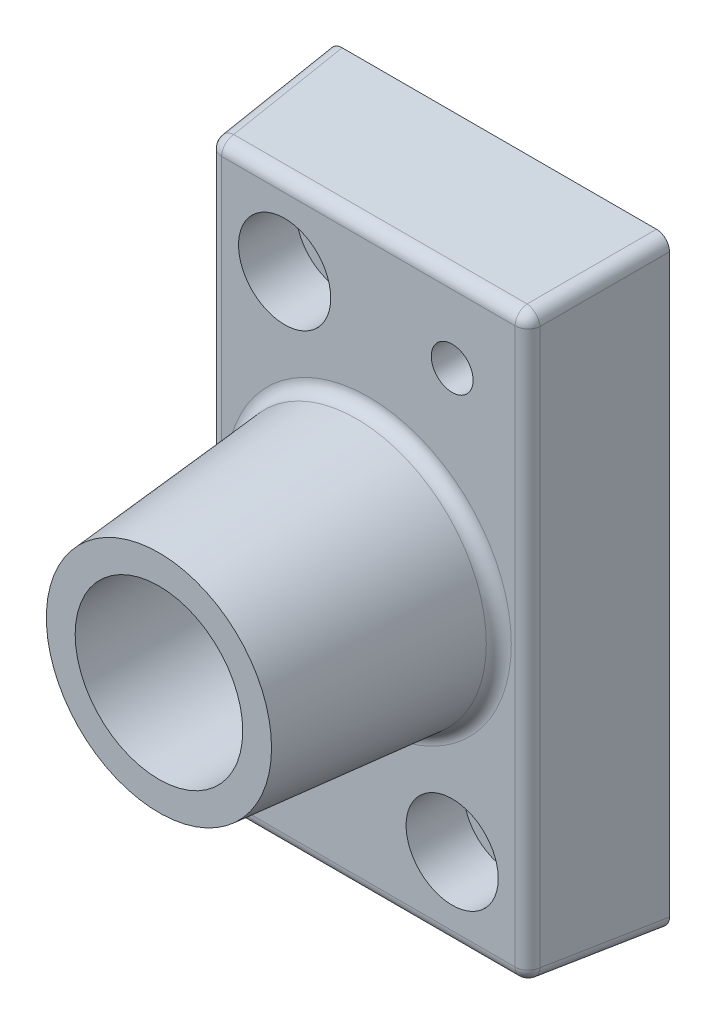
ISO-10303-21;
HEADER;
FILE_DESCRIPTION(('STEP AP214'),'2;1');
FILE_NAME('part.step','',(''),(''),'','','');
FILE_SCHEMA(('AUTOMOTIVE_DESIGN { 1 0 10303 214 1 1 1 1 }'));
ENDSEC;
DATA;
#1=APPLICATION_CONTEXT('core data for automotive mechanical design processes');
#2=APPLICATION_PROTOCOL_DEFINITION('international standard','automotive_design',2000,#1);
#3=PRODUCT_CONTEXT('',#1,'mechanical');
#4=PRODUCT('Part','Part','',(#3));
#5=PRODUCT_RELATED_PRODUCT_CATEGORY('part','',(#4));
#6=PRODUCT_DEFINITION_FORMATION('','',#4);
#7=PRODUCT_DEFINITION_CONTEXT('part definition',#1,'design');
#8=PRODUCT_DEFINITION('design','',#6,#7);
#9=PRODUCT_DEFINITION_SHAPE('','',#8);
#10=(LENGTH_UNIT() NAMED_UNIT(*) SI_UNIT(.MILLI.,.METRE.));
#11=(NAMED_UNIT(*) PLANE_ANGLE_UNIT() SI_UNIT($,.RADIAN.));
#12=(NAMED_UNIT(*) SI_UNIT($,.STERADIAN.) SOLID_ANGLE_UNIT());
#13=UNCERTAINTY_MEASURE_WITH_UNIT(LENGTH_MEASURE(1.E-05),#10,'distance_accuracy_value','');
#14=(GEOMETRIC_REPRESENTATION_CONTEXT(3) GLOBAL_UNCERTAINTY_ASSIGNED_CONTEXT((#13)) GLOBAL_UNIT_ASSIGNED_CONTEXT((#10,
#11,#12)) REPRESENTATION_CONTEXT('',''));
#15=CARTESIAN_POINT('',(0.,0.,0.));
#16=DIRECTION('',(0.,0.,1.));
#17=DIRECTION('',(1.,0.,0.));
#18=AXIS2_PLACEMENT_3D('',#15,#16,#17);
#19=CARTESIAN_POINT('',(-32.5,57.5000000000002,25.));
#20=DIRECTION('',(0.,0.,1.));
#21=DIRECTION('',(1.,0.,0.));
#22=AXIS2_PLACEMENT_3D('',#19,#20,#21);
#23=PLANE('',#22);
#24=CARTESIAN_POINT('',(-16.,-40.0000000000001,25.));
#25=DIRECTION('',(0.,0.,1.));
#26=DIRECTION('',(1.,0.,0.));
#27=AXIS2_PLACEMENT_3D('',#24,#25,#26);
#28=CIRCLE('',#27,4.);
#29=CARTESIAN_POINT('',(-12.,-40.0000000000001,25.));
#30=VERTEX_POINT('',#29);
#31=EDGE_CURVE('E529',#30,#30,#28,.T.);
#32=ORIENTED_EDGE('',*,*,#31,.F.);
#33=EDGE_LOOP('',(#32));
#34=FACE_BOUND('',#33,.T.);
#35=CARTESIAN_POINT('',(16.,40.,25.));
#36=DIRECTION('',(0.,0.,1.));
#37=DIRECTION('',(1.,0.,0.));
#38=AXIS2_PLACEMENT_3D('',#35,#36,#37);
#39=CIRCLE('',#38,4.);
#40=CARTESIAN_POINT('',(20.,40.,25.));
#41=VERTEX_POINT('',#40);
#42=EDGE_CURVE('E531',#41,#41,#39,.T.);
#43=ORIENTED_EDGE('',*,*,#42,.F.);
#44=EDGE_LOOP('',(#43));
#45=FACE_BOUND('',#44,.T.);
#46=CARTESIAN_POINT('',(16.0000000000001,-40.,25.));
#47=DIRECTION('',(0.,0.,1.));
#48=DIRECTION('',(1.,0.,0.));
#49=AXIS2_PLACEMENT_3D('',#46,#47,#48);
#50=CIRCLE('',#49,8.8);
#51=CARTESIAN_POINT('',(24.8000000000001,-40.,25.));
#52=VERTEX_POINT('',#51);
#53=EDGE_CURVE('E548',#52,#52,#50,.T.);
#54=ORIENTED_EDGE('',*,*,#53,.F.);
#55=EDGE_LOOP('',(#54));
#56=FACE_BOUND('',#55,.T.);
#57=CARTESIAN_POINT('',(-16.,40.,25.));
#58=DIRECTION('',(0.,0.,1.));
#59=DIRECTION('',(1.,0.,0.));
#60=AXIS2_PLACEMENT_3D('',#57,#58,#59);
#61=CIRCLE('',#60,8.8);
#62=CARTESIAN_POINT('',(-7.20000000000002,40.,25.));
#63=VERTEX_POINT('',#62);
#64=EDGE_CURVE('E560',#63,#63,#61,.T.);
#65=ORIENTED_EDGE('',*,*,#64,.F.);
#66=EDGE_LOOP('',(#65));
#67=FACE_BOUND('',#66,.T.);
#68=CARTESIAN_POINT('',(0.,0.,25.));
#69=DIRECTION('',(0.,0.,1.));
#70=DIRECTION('',(1.,0.,0.));
#71=AXIS2_PLACEMENT_3D('',#68,#69,#70);
#72=CIRCLE('',#71,27.2908279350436);
#73=CARTESIAN_POINT('',(27.2908279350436,0.,25.));
#74=VERTEX_POINT('',#73);
#75=EDGE_CURVE('E141',#74,#74,#72,.F.);
#76=ORIENTED_EDGE('',*,*,#75,.T.);
#77=EDGE_LOOP('',(#76));
#78=FACE_BOUND('',#77,.T.);
#79=DIRECTION('',(0.,-1.,0.));
#80=VECTOR('',#79,1.);
#81=CARTESIAN_POINT('',(28.0219554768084,55.312783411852,25.));
#82=LINE('',#81,#80);
#83=CARTESIAN_POINT('',(28.0219554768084,-53.0219554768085,25.));
#84=VERTEX_POINT('',#83);
#85=CARTESIAN_POINT('',(28.0219554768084,53.0219554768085,25.));
#86=VERTEX_POINT('',#85);
#87=EDGE_CURVE('E139',#84,#86,#82,.F.);
#88=ORIENTED_EDGE('',*,*,#87,.T.);
#89=DIRECTION('',(1.,0.,0.));
#90=VECTOR('',#89,1.);
#91=CARTESIAN_POINT('',(-30.312783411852,53.0219554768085,25.));
#92=LINE('',#91,#90);
#93=CARTESIAN_POINT('',(-28.0219554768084,53.0219554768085,25.));
#94=VERTEX_POINT('',#93);
#95=EDGE_CURVE('E111',#86,#94,#92,.F.);
#96=ORIENTED_EDGE('',*,*,#95,.T.);
#97=DIRECTION('',(0.,1.,0.));
#98=VECTOR('',#97,1.);
#99=CARTESIAN_POINT('',(-28.0219554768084,-55.312783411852,25.));
#100=LINE('',#99,#98);
#101=CARTESIAN_POINT('',(-28.0219554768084,-53.0219554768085,25.));
#102=VERTEX_POINT('',#101);
#103=EDGE_CURVE('E129',#94,#102,#100,.F.);
#104=ORIENTED_EDGE('',*,*,#103,.T.);
#105=DIRECTION('',(-1.,0.,0.));
#106=VECTOR('',#105,1.);
#107=CARTESIAN_POINT('',(30.312783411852,-53.0219554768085,25.));
#108=LINE('',#107,#106);
#109=EDGE_CURVE('E135',#102,#84,#108,.F.);
#110=ORIENTED_EDGE('',*,*,#109,.T.);
#111=EDGE_LOOP('',(#88,#96,#104,#110));
#112=FACE_BOUND('',#111,.T.);
#113=ADVANCED_FACE('F29',(#34,#45,#56,#67,#78,#112),#23,.T.);
#114=CARTESIAN_POINT('',(-32.5,57.5000000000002,0.));
#115=DIRECTION('',(-0.996194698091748,0.,0.0871557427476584));
#116=DIRECTION('',(0.0871557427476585,0.,0.996194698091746));
#117=AXIS2_PLACEMENT_3D('',#114,#115,#116);
#118=PLANE('',#117);
#119=DIRECTION('',(0.,-1.,0.));
#120=VECTOR('',#119,1.);
#121=CARTESIAN_POINT('',(-30.5124422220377,55.312783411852,22.7178893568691));
#122=LINE('',#121,#120);
#123=CARTESIAN_POINT('',(-30.5124422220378,-53.0219554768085,22.7178893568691));
#124=VERTEX_POINT('',#123);
#125=CARTESIAN_POINT('',(-30.5124422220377,53.0219554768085,22.7178893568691));
#126=VERTEX_POINT('',#125);
#127=EDGE_CURVE('E45',#124,#126,#122,.F.);
#128=ORIENTED_EDGE('',*,*,#127,.T.);
#129=DIRECTION('',(0.0868265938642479,-0.0868265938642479,0.992432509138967));
#130=VECTOR('',#129,1.);
#131=CARTESIAN_POINT('',(-32.5187754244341,55.0282886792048,-0.214604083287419));
#132=LINE('',#131,#130);
#133=CARTESIAN_POINT('',(-32.5,55.0095132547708,0.));
#134=VERTEX_POINT('',#133);
#135=EDGE_CURVE('E167',#126,#134,#132,.F.);
#136=ORIENTED_EDGE('',*,*,#135,.T.);
#137=DIRECTION('',(0.,-1.,0.));
#138=VECTOR('',#137,1.);
#139=CARTESIAN_POINT('',(-32.5,57.5000000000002,0.));
#140=LINE('',#139,#138);
#141=CARTESIAN_POINT('',(-32.5000000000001,-55.0095132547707,0.));
#142=VERTEX_POINT('',#141);
#143=EDGE_CURVE('E181',#134,#142,#140,.T.);
#144=ORIENTED_EDGE('',*,*,#143,.T.);
#145=DIRECTION('',(0.0868265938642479,0.0868265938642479,0.992432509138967));
#146=VECTOR('',#145,1.);
#147=CARTESIAN_POINT('',(-31.6518068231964,-54.161320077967,9.69489237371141));
#148=LINE('',#147,#146);
#149=EDGE_CURVE('E50',#142,#124,#148,.T.);
#150=ORIENTED_EDGE('',*,*,#149,.T.);
#151=EDGE_LOOP('',(#128,#136,#144,#150));
#152=FACE_BOUND('',#151,.T.);
#153=ADVANCED_FACE('F268',(#152),#118,.T.);
#154=CARTESIAN_POINT('',(-32.5000000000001,-57.5000000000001,0.));
#155=DIRECTION('',(0.,-0.996194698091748,0.0871557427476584));
#156=DIRECTION('',(0.,-0.0871557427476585,-0.996194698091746));
#157=AXIS2_PLACEMENT_3D('',#154,#155,#156);
#158=PLANE('',#157);
#159=DIRECTION('',(1.,0.,0.));
#160=VECTOR('',#159,1.);
#161=CARTESIAN_POINT('',(-32.5000000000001,-57.5000000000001,0.));
#162=LINE('',#161,#160);
#163=CARTESIAN_POINT('',(-30.0095132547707,-57.5000000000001,0.));
#164=VERTEX_POINT('',#163);
#165=CARTESIAN_POINT('',(30.0095132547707,-57.5000000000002,0.));
#166=VERTEX_POINT('',#165);
#167=EDGE_CURVE('E218',#164,#166,#162,.T.);
#168=ORIENTED_EDGE('',*,*,#167,.T.);
#169=DIRECTION('',(-0.086826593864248,0.0868265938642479,0.992432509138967));
#170=VECTOR('',#169,1.);
#171=CARTESIAN_POINT('',(29.5382629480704,-57.0287496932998,5.38641565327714));
#172=LINE('',#171,#170);
#173=CARTESIAN_POINT('',(28.0219554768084,-55.5124422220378,22.7178893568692));
#174=VERTEX_POINT('',#173);
#175=EDGE_CURVE('E163',#166,#174,#172,.T.);
#176=ORIENTED_EDGE('',*,*,#175,.T.);
#177=DIRECTION('',(1.,0.,0.));
#178=VECTOR('',#177,1.);
#179=CARTESIAN_POINT('',(-30.312783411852,-55.5124422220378,22.7178893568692));
#180=LINE('',#179,#178);
#181=CARTESIAN_POINT('',(-28.0219554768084,-55.5124422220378,22.7178893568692));
#182=VERTEX_POINT('',#181);
#183=EDGE_CURVE('E161',#174,#182,#180,.F.);
#184=ORIENTED_EDGE('',*,*,#183,.T.);
#185=DIRECTION('',(0.0868265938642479,0.0868265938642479,0.992432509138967));
#186=VECTOR('',#185,1.);
#187=CARTESIAN_POINT('',(-30.0282886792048,-57.5187754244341,-0.214604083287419));
#188=LINE('',#187,#186);
#189=EDGE_CURVE('E159',#182,#164,#188,.F.);
#190=ORIENTED_EDGE('',*,*,#189,.T.);
#191=EDGE_LOOP('',(#168,#176,#184,#190));
#192=FACE_BOUND('',#191,.T.);
#193=ADVANCED_FACE('F31',(#192),#158,.T.);
#194=CARTESIAN_POINT('',(32.5000000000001,57.5000000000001,0.));
#195=DIRECTION('',(0.996194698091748,0.,0.0871557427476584));
#196=DIRECTION('',(0.0871557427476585,0.,-0.996194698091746));
#197=AXIS2_PLACEMENT_3D('',#194,#195,#196);
#198=PLANE('',#197);
#199=DIRECTION('',(0.,1.,0.));
#200=VECTOR('',#199,1.);
#201=CARTESIAN_POINT('',(32.5000000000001,57.5000000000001,0.));
#202=LINE('',#201,#200);
#203=CARTESIAN_POINT('',(32.5000000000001,-55.0095132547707,0.));
#204=VERTEX_POINT('',#203);
#205=CARTESIAN_POINT('',(32.5000000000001,55.0095132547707,0.));
#206=VERTEX_POINT('',#205);
#207=EDGE_CURVE('E187',#204,#206,#202,.T.);
#208=ORIENTED_EDGE('',*,*,#207,.T.);
#209=DIRECTION('',(-0.086826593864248,-0.086826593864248,0.992432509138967));
#210=VECTOR('',#209,1.);
#211=CARTESIAN_POINT('',(32.5187754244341,55.0282886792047,-0.214604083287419));
#212=LINE('',#211,#210);
#213=CARTESIAN_POINT('',(30.5124422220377,53.0219554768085,22.7178893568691));
#214=VERTEX_POINT('',#213);
#215=EDGE_CURVE('E157',#206,#214,#212,.T.);
#216=ORIENTED_EDGE('',*,*,#215,.T.);
#217=DIRECTION('',(0.,1.,0.));
#218=VECTOR('',#217,1.);
#219=CARTESIAN_POINT('',(30.5124422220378,-55.312783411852,22.7178893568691));
#220=LINE('',#219,#218);
#221=CARTESIAN_POINT('',(30.5124422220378,-53.0219554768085,22.7178893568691));
#222=VERTEX_POINT('',#221);
#223=EDGE_CURVE('E155',#214,#222,#220,.F.);
#224=ORIENTED_EDGE('',*,*,#223,.T.);
#225=DIRECTION('',(-0.086826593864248,0.0868265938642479,0.992432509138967));
#226=VECTOR('',#225,1.);
#227=CARTESIAN_POINT('',(31.6518068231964,-54.1613200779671,9.69489237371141));
#228=LINE('',#227,#226);
#229=EDGE_CURVE('E153',#222,#204,#228,.F.);
#230=ORIENTED_EDGE('',*,*,#229,.T.);
#231=EDGE_LOOP('',(#208,#216,#224,#230));
#232=FACE_BOUND('',#231,.T.);
#233=ADVANCED_FACE('F246',(#232),#198,.T.);
#234=CARTESIAN_POINT('',(-32.5,57.5000000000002,0.));
#235=DIRECTION('',(0.,0.996194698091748,0.0871557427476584));
#236=DIRECTION('',(0.,-0.0871557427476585,0.996194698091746));
#237=AXIS2_PLACEMENT_3D('',#234,#235,#236);
#238=PLANE('',#237);
#239=DIRECTION('',(-1.,0.,0.));
#240=VECTOR('',#239,1.);
#241=CARTESIAN_POINT('',(30.312783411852,55.5124422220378,22.7178893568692));
#242=LINE('',#241,#240);
#243=CARTESIAN_POINT('',(-28.0219554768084,55.5124422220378,22.7178893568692));
#244=VERTEX_POINT('',#243);
#245=CARTESIAN_POINT('',(28.0219554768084,55.5124422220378,22.7178893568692));
#246=VERTEX_POINT('',#245);
#247=EDGE_CURVE('E113',#244,#246,#242,.F.);
#248=ORIENTED_EDGE('',*,*,#247,.T.);
#249=DIRECTION('',(-0.086826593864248,-0.086826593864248,0.992432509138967));
#250=VECTOR('',#249,1.);
#251=CARTESIAN_POINT('',(29.5382629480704,57.0287496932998,5.38641565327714));
#252=LINE('',#251,#250);
#253=CARTESIAN_POINT('',(30.0095132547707,57.5000000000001,0.));
#254=VERTEX_POINT('',#253);
#255=EDGE_CURVE('E151',#246,#254,#252,.F.);
#256=ORIENTED_EDGE('',*,*,#255,.T.);
#257=DIRECTION('',(-1.,0.,0.));
#258=VECTOR('',#257,1.);
#259=CARTESIAN_POINT('',(-32.5,57.5000000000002,0.));
#260=LINE('',#259,#258);
#261=CARTESIAN_POINT('',(-30.0095132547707,57.5000000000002,0.));
#262=VERTEX_POINT('',#261);
#263=EDGE_CURVE('E179',#254,#262,#260,.T.);
#264=ORIENTED_EDGE('',*,*,#263,.T.);
#265=DIRECTION('',(0.0868265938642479,-0.0868265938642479,0.992432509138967));
#266=VECTOR('',#265,1.);
#267=CARTESIAN_POINT('',(-30.0282886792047,57.5187754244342,-0.214604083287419));
#268=LINE('',#267,#266);
#269=EDGE_CURVE('E144',#262,#244,#268,.T.);
#270=ORIENTED_EDGE('',*,*,#269,.T.);
#271=EDGE_LOOP('',(#248,#256,#264,#270));
#272=FACE_BOUND('',#271,.T.);
#273=ADVANCED_FACE('F185',(#272),#238,.T.);
#274=CARTESIAN_POINT('',(-32.5,57.5000000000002,0.));
#275=DIRECTION('',(0.,0.,1.));
#276=DIRECTION('',(1.,0.,0.));
#277=AXIS2_PLACEMENT_3D('',#274,#275,#276);
#278=PLANE('',#277);
#279=CARTESIAN_POINT('',(-16.,-40.0000000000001,0.));
#280=DIRECTION('',(0.,0.,1.));
#281=DIRECTION('',(1.,0.,0.));
#282=AXIS2_PLACEMENT_3D('',#279,#280,#281);
#283=CIRCLE('',#282,4.);
#284=CARTESIAN_POINT('',(-12.,-40.0000000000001,0.));
#285=VERTEX_POINT('',#284);
#286=EDGE_CURVE('E527',#285,#285,#283,.T.);
#287=ORIENTED_EDGE('',*,*,#286,.T.);
#288=EDGE_LOOP('',(#287));
#289=FACE_BOUND('',#288,.T.);
#290=CARTESIAN_POINT('',(16.,40.,0.));
#291=DIRECTION('',(0.,0.,1.));
#292=DIRECTION('',(1.,0.,0.));
#293=AXIS2_PLACEMENT_3D('',#290,#291,#292);
#294=CIRCLE('',#293,4.);
#295=CARTESIAN_POINT('',(20.,40.,0.));
#296=VERTEX_POINT('',#295);
#297=EDGE_CURVE('E536',#296,#296,#294,.T.);
#298=ORIENTED_EDGE('',*,*,#297,.T.);
#299=EDGE_LOOP('',(#298));
#300=FACE_BOUND('',#299,.T.);
#301=CARTESIAN_POINT('',(16.0000000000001,-40.,0.));
#302=DIRECTION('',(0.,0.,1.));
#303=DIRECTION('',(1.,0.,0.));
#304=AXIS2_PLACEMENT_3D('',#301,#302,#303);
#305=CIRCLE('',#304,5.49999999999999);
#306=CARTESIAN_POINT('',(21.5000000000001,-40.,0.));
#307=VERTEX_POINT('',#306);
#308=EDGE_CURVE('E539',#307,#307,#305,.T.);
#309=ORIENTED_EDGE('',*,*,#308,.T.);
#310=EDGE_LOOP('',(#309));
#311=FACE_BOUND('',#310,.T.);
#312=CARTESIAN_POINT('',(-16.,40.,0.));
#313=DIRECTION('',(0.,0.,1.));
#314=DIRECTION('',(1.,0.,0.));
#315=AXIS2_PLACEMENT_3D('',#312,#313,#314);
#316=CIRCLE('',#315,5.49999999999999);
#317=CARTESIAN_POINT('',(-10.5,40.,0.));
#318=VERTEX_POINT('',#317);
#319=EDGE_CURVE('E551',#318,#318,#316,.T.);
#320=ORIENTED_EDGE('',*,*,#319,.T.);
#321=EDGE_LOOP('',(#320));
#322=FACE_BOUND('',#321,.T.);
#323=CARTESIAN_POINT('',(0.,0.,0.));
#324=DIRECTION('',(0.,0.,-1.));
#325=DIRECTION('',(-1.,0.,0.));
#326=AXIS2_PLACEMENT_3D('',#323,#324,#325);
#327=CIRCLE('',#326,18.);
#328=CARTESIAN_POINT('',(-18.,0.,0.));
#329=VERTEX_POINT('',#328);
#330=EDGE_CURVE('E566',#329,#329,#327,.T.);
#331=ORIENTED_EDGE('',*,*,#330,.F.);
#332=EDGE_LOOP('',(#331));
#333=FACE_BOUND('',#332,.T.);
#334=ORIENTED_EDGE('',*,*,#263,.F.);
#335=CARTESIAN_POINT('',(29.9904504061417,54.9904504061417,0.));
#336=DIRECTION('',(0.,0.,1.));
#337=DIRECTION('',(0.707106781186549,0.707106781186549,0.));
#338=AXIS2_PLACEMENT_3D('',#335,#336,#337);
#339=ELLIPSE('',#338,2.51906298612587,2.5);
#340=EDGE_CURVE('E11',#254,#206,#339,.F.);
#341=ORIENTED_EDGE('',*,*,#340,.T.);
#342=ORIENTED_EDGE('',*,*,#207,.F.);
#343=CARTESIAN_POINT('',(29.9904504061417,-54.9904504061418,0.));
#344=DIRECTION('',(0.,0.,1.));
#345=DIRECTION('',(0.707106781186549,-0.707106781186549,0.));
#346=AXIS2_PLACEMENT_3D('',#343,#344,#345);
#347=ELLIPSE('',#346,2.51906298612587,2.5);
#348=EDGE_CURVE('E171',#204,#166,#347,.F.);
#349=ORIENTED_EDGE('',*,*,#348,.T.);
#350=ORIENTED_EDGE('',*,*,#167,.F.);
#351=CARTESIAN_POINT('',(-29.9904504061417,-54.9904504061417,0.));
#352=DIRECTION('',(0.,0.,1.));
#353=DIRECTION('',(-0.707106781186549,-0.707106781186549,0.));
#354=AXIS2_PLACEMENT_3D('',#351,#352,#353);
#355=ELLIPSE('',#354,2.51906298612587,2.5);
#356=EDGE_CURVE('E169',#164,#142,#355,.F.);
#357=ORIENTED_EDGE('',*,*,#356,.T.);
#358=ORIENTED_EDGE('',*,*,#143,.F.);
#359=CARTESIAN_POINT('',(-29.9904504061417,54.9904504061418,0.));
#360=DIRECTION('',(0.,0.,1.));
#361=DIRECTION('',(-0.707106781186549,0.707106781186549,0.));
#362=AXIS2_PLACEMENT_3D('',#359,#360,#361);
#363=ELLIPSE('',#362,2.51906298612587,2.5);
#364=EDGE_CURVE('E38',#134,#262,#363,.F.);
#365=ORIENTED_EDGE('',*,*,#364,.T.);
#366=EDGE_LOOP('',(#334,#341,#342,#349,#350,#357,#358,#365));
#367=FACE_BOUND('',#366,.T.);
#368=ADVANCED_FACE('F178',(#289,#300,#311,#322,#333,#367),#278,.F.);
#369=CARTESIAN_POINT('',(0.,0.,25.));
#370=DIRECTION('',(0.,0.,-1.));
#371=DIRECTION('',(1.,0.,0.));
#372=AXIS2_PLACEMENT_3D('',#369,#370,#371);
#373=CONICAL_SURFACE('',#372,25.,0.0872664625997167);
#374=CARTESIAN_POINT('',(0.,0.,27.2821106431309));
#375=DIRECTION('',(0.,0.,1.));
#376=DIRECTION('',(1.,0.,0.));
#377=AXIS2_PLACEMENT_3D('',#374,#375,#376);
#378=CIRCLE('',#377,24.8003411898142);
#379=CARTESIAN_POINT('',(24.8003411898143,0.,27.2821106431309));
#380=VERTEX_POINT('',#379);
#381=EDGE_CURVE('E136',#380,#380,#378,.T.);
#382=ORIENTED_EDGE('',*,*,#381,.T.);
#383=EDGE_LOOP('',(#382));
#384=FACE_BOUND('',#383,.T.);
#385=CARTESIAN_POINT('',(0.,0.,65.));
#386=DIRECTION('',(0.,0.,1.));
#387=DIRECTION('',(1.,0.,0.));
#388=AXIS2_PLACEMENT_3D('',#385,#386,#387);
#389=CIRCLE('',#388,21.500453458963);
#390=CARTESIAN_POINT('',(21.5004534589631,0.,65.));
#391=VERTEX_POINT('',#390);
#392=EDGE_CURVE('E214',#391,#391,#389,.T.);
#393=ORIENTED_EDGE('',*,*,#392,.F.);
#394=EDGE_LOOP('',(#393));
#395=FACE_BOUND('',#394,.T.);
#396=ADVANCED_FACE('F305',(#384,#395),#373,.T.);
#397=CARTESIAN_POINT('',(0.,0.,65.));
#398=DIRECTION('',(0.,0.,1.));
#399=DIRECTION('',(1.,0.,0.));
#400=AXIS2_PLACEMENT_3D('',#397,#398,#399);
#401=PLANE('',#400);
#402=CARTESIAN_POINT('',(0.,0.,65.));
#403=DIRECTION('',(0.,0.,1.));
#404=DIRECTION('',(1.,0.,0.));
#405=AXIS2_PLACEMENT_3D('',#402,#403,#404);
#406=CIRCLE('',#405,16.);
#407=CARTESIAN_POINT('',(16.,0.,65.));
#408=VERTEX_POINT('',#407);
#409=EDGE_CURVE('E563',#408,#408,#406,.T.);
#410=ORIENTED_EDGE('',*,*,#409,.F.);
#411=EDGE_LOOP('',(#410));
#412=FACE_BOUND('',#411,.T.);
#413=ORIENTED_EDGE('',*,*,#392,.T.);
#414=EDGE_LOOP('',(#413));
#415=FACE_BOUND('',#414,.T.);
#416=ADVANCED_FACE('F311',(#412,#415),#401,.T.);
#417=CARTESIAN_POINT('',(0.,0.,27.5));
#418=DIRECTION('',(0.,0.,1.));
#419=DIRECTION('',(1.,0.,0.));
#420=AXIS2_PLACEMENT_3D('',#417,#418,#419);
#421=TOROIDAL_SURFACE('',#420,27.2908279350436,2.5);
#422=ORIENTED_EDGE('',*,*,#75,.F.);
#423=EDGE_LOOP('',(#422));
#424=FACE_BOUND('',#423,.T.);
#425=ORIENTED_EDGE('',*,*,#381,.F.);
#426=EDGE_LOOP('',(#425));
#427=FACE_BOUND('',#426,.T.);
#428=ADVANCED_FACE('F319',(#424,#427),#421,.F.);
#429=CARTESIAN_POINT('',(29.1613200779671,-54.1613200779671,9.47700301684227));
#430=DIRECTION('',(0.0868265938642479,-0.0868265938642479,-0.992432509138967));
#431=DIRECTION('',(-0.996194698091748,0.,-0.0871557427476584));
#432=AXIS2_PLACEMENT_3D('',#429,#430,#431);
#433=CYLINDRICAL_SURFACE('',#432,2.5);
#434=ORIENTED_EDGE('',*,*,#348,.F.);
#435=ORIENTED_EDGE('',*,*,#229,.F.);
#436=CARTESIAN_POINT('',(28.0219554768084,-53.0219554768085,22.5));
#437=DIRECTION('',(-0.0868265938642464,0.0868265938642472,0.992432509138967));
#438=DIRECTION('',(0.,-0.996194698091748,0.0871557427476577));
#439=AXIS2_PLACEMENT_3D('',#436,#437,#438);
#440=CIRCLE('',#439,2.5);
#441=EDGE_CURVE('E211',#174,#222,#440,.T.);
#442=ORIENTED_EDGE('',*,*,#441,.F.);
#443=ORIENTED_EDGE('',*,*,#175,.F.);
#444=EDGE_LOOP('',(#434,#435,#442,#443));
#445=FACE_BOUND('',#444,.T.);
#446=ADVANCED_FACE('F249',(#445),#433,.T.);
#447=CARTESIAN_POINT('',(-32.5000000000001,-53.0219554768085,22.5));
#448=DIRECTION('',(1.,0.,0.));
#449=DIRECTION('',(0.,1.,0.));
#450=AXIS2_PLACEMENT_3D('',#447,#448,#449);
#451=CYLINDRICAL_SURFACE('',#450,2.5);
#452=CARTESIAN_POINT('',(-28.0219554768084,-53.0219554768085,22.5));
#453=DIRECTION('',(-1.,0.,0.));
#454=DIRECTION('',(0.,0.,1.));
#455=AXIS2_PLACEMENT_3D('',#452,#453,#454);
#456=CIRCLE('',#455,2.5);
#457=EDGE_CURVE('E205',#182,#102,#456,.T.);
#458=ORIENTED_EDGE('',*,*,#457,.F.);
#459=ORIENTED_EDGE('',*,*,#183,.F.);
#460=CARTESIAN_POINT('',(28.0219554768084,-53.0219554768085,22.5));
#461=DIRECTION('',(1.,0.,0.));
#462=DIRECTION('',(0.,0.,-1.));
#463=AXIS2_PLACEMENT_3D('',#460,#461,#462);
#464=CIRCLE('',#463,2.5);
#465=EDGE_CURVE('E208',#84,#174,#464,.T.);
#466=ORIENTED_EDGE('',*,*,#465,.F.);
#467=ORIENTED_EDGE('',*,*,#109,.F.);
#468=EDGE_LOOP('',(#458,#459,#466,#467));
#469=FACE_BOUND('',#468,.T.);
#470=ADVANCED_FACE('F229',(#469),#451,.T.);
#471=CARTESIAN_POINT('',(-30.0282886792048,-55.0282886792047,-0.432493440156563));
#472=DIRECTION('',(-0.0868265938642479,-0.0868265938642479,-0.992432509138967));
#473=DIRECTION('',(-0.996194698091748,0.,0.0871557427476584));
#474=AXIS2_PLACEMENT_3D('',#471,#472,#473);
#475=CYLINDRICAL_SURFACE('',#474,2.5);
#476=ORIENTED_EDGE('',*,*,#356,.F.);
#477=ORIENTED_EDGE('',*,*,#189,.F.);
#478=CARTESIAN_POINT('',(-28.0219554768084,-53.0219554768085,22.5));
#479=DIRECTION('',(0.0868265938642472,0.0868265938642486,0.992432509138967));
#480=DIRECTION('',(0.,-0.996194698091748,0.0871557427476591));
#481=AXIS2_PLACEMENT_3D('',#478,#479,#480);
#482=CIRCLE('',#481,2.5);
#483=EDGE_CURVE('E202',#124,#182,#482,.T.);
#484=ORIENTED_EDGE('',*,*,#483,.F.);
#485=ORIENTED_EDGE('',*,*,#149,.F.);
#486=EDGE_LOOP('',(#476,#477,#484,#485));
#487=FACE_BOUND('',#486,.T.);
#488=ADVANCED_FACE('F256',(#487),#475,.T.);
#489=CARTESIAN_POINT('',(28.0219554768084,-53.0219554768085,22.5));
#490=DIRECTION('',(0.,0.,1.));
#491=DIRECTION('',(1.,0.,0.));
#492=AXIS2_PLACEMENT_3D('',#489,#490,#491);
#493=SPHERICAL_SURFACE('',#492,2.5);
#494=ORIENTED_EDGE('',*,*,#465,.T.);
#495=ORIENTED_EDGE('',*,*,#441,.T.);
#496=CARTESIAN_POINT('',(28.0219554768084,-53.0219554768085,22.5));
#497=DIRECTION('',(0.,-1.,0.));
#498=DIRECTION('',(0.,0.,-1.));
#499=AXIS2_PLACEMENT_3D('',#496,#497,#498);
#500=CIRCLE('',#499,2.5);
#501=EDGE_CURVE('E199',#84,#222,#500,.F.);
#502=ORIENTED_EDGE('',*,*,#501,.F.);
#503=EDGE_LOOP('',(#494,#495,#502));
#504=FACE_BOUND('',#503,.T.);
#505=ADVANCED_FACE('F232',(#504),#493,.T.);
#506=CARTESIAN_POINT('',(-28.0219554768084,-53.0219554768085,22.5));
#507=DIRECTION('',(0.,0.,1.));
#508=DIRECTION('',(1.,0.,0.));
#509=AXIS2_PLACEMENT_3D('',#506,#507,#508);
#510=SPHERICAL_SURFACE('',#509,2.5);
#511=ORIENTED_EDGE('',*,*,#483,.T.);
#512=ORIENTED_EDGE('',*,*,#457,.T.);
#513=CARTESIAN_POINT('',(-28.0219554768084,-53.0219554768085,22.5));
#514=DIRECTION('',(0.,-1.,0.));
#515=DIRECTION('',(1.,0.,0.));
#516=AXIS2_PLACEMENT_3D('',#513,#514,#515);
#517=CIRCLE('',#516,2.5);
#518=EDGE_CURVE('E132',#124,#102,#517,.F.);
#519=ORIENTED_EDGE('',*,*,#518,.F.);
#520=EDGE_LOOP('',(#511,#512,#519));
#521=FACE_BOUND('',#520,.T.);
#522=ADVANCED_FACE('F258',(#521),#510,.T.);
#523=CARTESIAN_POINT('',(29.5382629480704,54.5382629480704,5.16852629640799));
#524=DIRECTION('',(0.086826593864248,0.086826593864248,-0.992432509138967));
#525=DIRECTION('',(0.,0.996194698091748,0.0871557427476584));
#526=AXIS2_PLACEMENT_3D('',#523,#524,#525);
#527=CYLINDRICAL_SURFACE('',#526,2.5);
#528=ORIENTED_EDGE('',*,*,#340,.F.);
#529=ORIENTED_EDGE('',*,*,#255,.F.);
#530=CARTESIAN_POINT('',(28.0219554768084,53.0219554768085,22.5));
#531=DIRECTION('',(-0.0868265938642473,-0.0868265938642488,0.992432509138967));
#532=DIRECTION('',(0.,-0.996194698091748,-0.0871557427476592));
#533=AXIS2_PLACEMENT_3D('',#530,#531,#532);
#534=CIRCLE('',#533,2.5);
#535=EDGE_CURVE('E195',#214,#246,#534,.T.);
#536=ORIENTED_EDGE('',*,*,#535,.F.);
#537=ORIENTED_EDGE('',*,*,#215,.F.);
#538=EDGE_LOOP('',(#528,#529,#536,#537));
#539=FACE_BOUND('',#538,.T.);
#540=ADVANCED_FACE('F242',(#539),#527,.T.);
#541=CARTESIAN_POINT('',(28.0219554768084,57.5000000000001,22.5));
#542=DIRECTION('',(0.,1.,0.));
#543=DIRECTION('',(-1.,0.,0.));
#544=AXIS2_PLACEMENT_3D('',#541,#542,#543);
#545=CYLINDRICAL_SURFACE('',#544,2.5);
#546=ORIENTED_EDGE('',*,*,#501,.T.);
#547=ORIENTED_EDGE('',*,*,#223,.F.);
#548=CARTESIAN_POINT('',(28.0219554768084,53.0219554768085,22.5));
#549=DIRECTION('',(0.,1.,0.));
#550=DIRECTION('',(-1.,0.,0.));
#551=AXIS2_PLACEMENT_3D('',#548,#549,#550);
#552=CIRCLE('',#551,2.5);
#553=EDGE_CURVE('E126',#86,#214,#552,.T.);
#554=ORIENTED_EDGE('',*,*,#553,.F.);
#555=ORIENTED_EDGE('',*,*,#87,.F.);
#556=EDGE_LOOP('',(#546,#547,#554,#555));
#557=FACE_BOUND('',#556,.T.);
#558=ADVANCED_FACE('F235',(#557),#545,.T.);
#559=CARTESIAN_POINT('',(-28.0219554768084,57.5000000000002,22.5));
#560=DIRECTION('',(0.,-1.,0.));
#561=DIRECTION('',(1.,0.,0.));
#562=AXIS2_PLACEMENT_3D('',#559,#560,#561);
#563=CYLINDRICAL_SURFACE('',#562,2.5);
#564=ORIENTED_EDGE('',*,*,#518,.T.);
#565=ORIENTED_EDGE('',*,*,#103,.F.);
#566=CARTESIAN_POINT('',(-28.0219554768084,53.0219554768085,22.5));
#567=DIRECTION('',(0.,1.,0.));
#568=DIRECTION('',(0.,0.,1.));
#569=AXIS2_PLACEMENT_3D('',#566,#567,#568);
#570=CIRCLE('',#569,2.5);
#571=EDGE_CURVE('E120',#126,#94,#570,.T.);
#572=ORIENTED_EDGE('',*,*,#571,.F.);
#573=ORIENTED_EDGE('',*,*,#127,.F.);
#574=EDGE_LOOP('',(#564,#565,#572,#573));
#575=FACE_BOUND('',#574,.T.);
#576=ADVANCED_FACE('F130',(#575),#563,.T.);
#577=CARTESIAN_POINT('',(-30.0282886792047,55.0282886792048,-0.432493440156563));
#578=DIRECTION('',(-0.0868265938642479,0.0868265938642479,-0.992432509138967));
#579=DIRECTION('',(-0.996194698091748,0.,0.0871557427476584));
#580=AXIS2_PLACEMENT_3D('',#577,#578,#579);
#581=CYLINDRICAL_SURFACE('',#580,2.5);
#582=ORIENTED_EDGE('',*,*,#364,.F.);
#583=ORIENTED_EDGE('',*,*,#135,.F.);
#584=CARTESIAN_POINT('',(-28.0219554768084,53.0219554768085,22.5));
#585=DIRECTION('',(0.0868265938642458,-0.0868265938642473,0.992432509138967));
#586=DIRECTION('',(0.,-0.996194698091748,-0.0871557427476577));
#587=AXIS2_PLACEMENT_3D('',#584,#585,#586);
#588=CIRCLE('',#587,2.5);
#589=EDGE_CURVE('E124',#244,#126,#588,.T.);
#590=ORIENTED_EDGE('',*,*,#589,.F.);
#591=ORIENTED_EDGE('',*,*,#269,.F.);
#592=EDGE_LOOP('',(#582,#583,#590,#591));
#593=FACE_BOUND('',#592,.T.);
#594=ADVANCED_FACE('F189',(#593),#581,.T.);
#595=CARTESIAN_POINT('',(28.0219554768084,53.0219554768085,22.5));
#596=DIRECTION('',(0.,0.,1.));
#597=DIRECTION('',(1.,0.,0.));
#598=AXIS2_PLACEMENT_3D('',#595,#596,#597);
#599=SPHERICAL_SURFACE('',#598,2.5);
#600=ORIENTED_EDGE('',*,*,#553,.T.);
#601=ORIENTED_EDGE('',*,*,#535,.T.);
#602=CARTESIAN_POINT('',(28.0219554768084,53.0219554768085,22.5));
#603=DIRECTION('',(1.,0.,0.));
#604=DIRECTION('',(0.,0.,-1.));
#605=AXIS2_PLACEMENT_3D('',#602,#603,#604);
#606=CIRCLE('',#605,2.5);
#607=EDGE_CURVE('E116',#86,#246,#606,.F.);
#608=ORIENTED_EDGE('',*,*,#607,.F.);
#609=EDGE_LOOP('',(#600,#601,#608));
#610=FACE_BOUND('',#609,.T.);
#611=ADVANCED_FACE('F239',(#610),#599,.T.);
#612=CARTESIAN_POINT('',(-28.0219554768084,53.0219554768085,22.5));
#613=DIRECTION('',(0.,0.,1.));
#614=DIRECTION('',(1.,0.,0.));
#615=AXIS2_PLACEMENT_3D('',#612,#613,#614);
#616=SPHERICAL_SURFACE('',#615,2.5);
#617=ORIENTED_EDGE('',*,*,#589,.T.);
#618=ORIENTED_EDGE('',*,*,#571,.T.);
#619=CARTESIAN_POINT('',(-28.0219554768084,53.0219554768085,22.5));
#620=DIRECTION('',(-1.,0.,0.));
#621=DIRECTION('',(0.,0.,1.));
#622=AXIS2_PLACEMENT_3D('',#619,#620,#621);
#623=CIRCLE('',#622,2.5);
#624=EDGE_CURVE('E107',#244,#94,#623,.F.);
#625=ORIENTED_EDGE('',*,*,#624,.F.);
#626=EDGE_LOOP('',(#617,#618,#625));
#627=FACE_BOUND('',#626,.T.);
#628=ADVANCED_FACE('F122',(#627),#616,.T.);
#629=CARTESIAN_POINT('',(-32.5,53.0219554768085,22.5));
#630=DIRECTION('',(-1.,0.,0.));
#631=DIRECTION('',(0.,0.,1.));
#632=AXIS2_PLACEMENT_3D('',#629,#630,#631);
#633=CYLINDRICAL_SURFACE('',#632,2.5);
#634=ORIENTED_EDGE('',*,*,#607,.T.);
#635=ORIENTED_EDGE('',*,*,#247,.F.);
#636=ORIENTED_EDGE('',*,*,#624,.T.);
#637=ORIENTED_EDGE('',*,*,#95,.F.);
#638=EDGE_LOOP('',(#634,#635,#636,#637));
#639=FACE_BOUND('',#638,.T.);
#640=ADVANCED_FACE('F109',(#639),#633,.T.);
#641=CARTESIAN_POINT('',(0.,0.,8.03));
#642=DIRECTION('',(0.,0.,-1.));
#643=DIRECTION('',(-1.,0.,0.));
#644=AXIS2_PLACEMENT_3D('',#641,#642,#643);
#645=CYLINDRICAL_SURFACE('',#644,18.);
#646=CARTESIAN_POINT('',(0.,0.,8.03));
#647=DIRECTION('',(0.,0.,-1.));
#648=DIRECTION('',(-1.,0.,0.));
#649=AXIS2_PLACEMENT_3D('',#646,#647,#648);
#650=CIRCLE('',#649,18.);
#651=CARTESIAN_POINT('',(-18.,0.,8.03));
#652=VERTEX_POINT('',#651);
#653=EDGE_CURVE('E117',#652,#652,#650,.T.);
#654=ORIENTED_EDGE('',*,*,#653,.F.);
#655=EDGE_LOOP('',(#654));
#656=FACE_BOUND('',#655,.T.);
#657=ORIENTED_EDGE('',*,*,#330,.T.);
#658=EDGE_LOOP('',(#657));
#659=FACE_BOUND('',#658,.T.);
#660=ADVANCED_FACE('F406',(#656,#659),#645,.F.);
#661=CARTESIAN_POINT('',(0.,0.,8.03));
#662=DIRECTION('',(0.,0.,-1.));
#663=DIRECTION('',(-1.,0.,0.));
#664=AXIS2_PLACEMENT_3D('',#661,#662,#663);
#665=PLANE('',#664);
#666=CARTESIAN_POINT('',(0.,0.,8.03));
#667=DIRECTION('',(0.,0.,-1.));
#668=DIRECTION('',(-1.,0.,0.));
#669=AXIS2_PLACEMENT_3D('',#666,#667,#668);
#670=CIRCLE('',#669,16.);
#671=CARTESIAN_POINT('',(-16.,0.,8.03));
#672=VERTEX_POINT('',#671);
#673=EDGE_CURVE('E33',#672,#672,#670,.T.);
#674=ORIENTED_EDGE('',*,*,#673,.F.);
#675=EDGE_LOOP('',(#674));
#676=FACE_BOUND('',#675,.T.);
#677=ORIENTED_EDGE('',*,*,#653,.T.);
#678=EDGE_LOOP('',(#677));
#679=FACE_BOUND('',#678,.T.);
#680=ADVANCED_FACE('F414',(#676,#679),#665,.T.);
#681=CARTESIAN_POINT('',(0.,0.,0.));
#682=DIRECTION('',(0.,0.,1.));
#683=DIRECTION('',(1.,0.,0.));
#684=AXIS2_PLACEMENT_3D('',#681,#682,#683);
#685=CYLINDRICAL_SURFACE('',#684,16.);
#686=ORIENTED_EDGE('',*,*,#673,.T.);
#687=EDGE_LOOP('',(#686));
#688=FACE_BOUND('',#687,.T.);
#689=ORIENTED_EDGE('',*,*,#409,.T.);
#690=EDGE_LOOP('',(#689));
#691=FACE_BOUND('',#690,.T.);
#692=ADVANCED_FACE('F423',(#688,#691),#685,.F.);
#693=CARTESIAN_POINT('',(-16.,40.,25.));
#694=DIRECTION('',(0.,0.,1.));
#695=DIRECTION('',(1.,0.,0.));
#696=AXIS2_PLACEMENT_3D('',#693,#694,#695);
#697=CYLINDRICAL_SURFACE('',#696,8.8);
#698=CARTESIAN_POINT('',(-16.,40.,14.));
#699=DIRECTION('',(0.,0.,1.));
#700=DIRECTION('',(1.,0.,0.));
#701=AXIS2_PLACEMENT_3D('',#698,#699,#700);
#702=CIRCLE('',#701,8.8);
#703=CARTESIAN_POINT('',(-7.20000000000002,40.,14.));
#704=VERTEX_POINT('',#703);
#705=EDGE_CURVE('E557',#704,#704,#702,.T.);
#706=ORIENTED_EDGE('',*,*,#705,.F.);
#707=EDGE_LOOP('',(#706));
#708=FACE_BOUND('',#707,.T.);
#709=ORIENTED_EDGE('',*,*,#64,.T.);
#710=EDGE_LOOP('',(#709));
#711=FACE_BOUND('',#710,.T.);
#712=ADVANCED_FACE('F432',(#708,#711),#697,.F.);
#713=CARTESIAN_POINT('',(-10.5,40.0000000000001,14.));
#714=DIRECTION('',(0.,0.,-1.));
#715=DIRECTION('',(-1.,0.,0.));
#716=AXIS2_PLACEMENT_3D('',#713,#714,#715);
#717=PLANE('',#716);
#718=CARTESIAN_POINT('',(-16.,40.,14.));
#719=DIRECTION('',(0.,0.,1.));
#720=DIRECTION('',(1.,0.,0.));
#721=AXIS2_PLACEMENT_3D('',#718,#719,#720);
#722=CIRCLE('',#721,5.5);
#723=CARTESIAN_POINT('',(-10.5,40.,14.));
#724=VERTEX_POINT('',#723);
#725=EDGE_CURVE('E554',#724,#724,#722,.T.);
#726=ORIENTED_EDGE('',*,*,#725,.F.);
#727=EDGE_LOOP('',(#726));
#728=FACE_BOUND('',#727,.T.);
#729=ORIENTED_EDGE('',*,*,#705,.T.);
#730=EDGE_LOOP('',(#729));
#731=FACE_BOUND('',#730,.T.);
#732=ADVANCED_FACE('F441',(#728,#731),#717,.F.);
#733=CARTESIAN_POINT('',(-16.,40.,25.));
#734=DIRECTION('',(0.,0.,1.));
#735=DIRECTION('',(1.,0.,0.));
#736=AXIS2_PLACEMENT_3D('',#733,#734,#735);
#737=CYLINDRICAL_SURFACE('',#736,5.5);
#738=ORIENTED_EDGE('',*,*,#319,.F.);
#739=EDGE_LOOP('',(#738));
#740=FACE_BOUND('',#739,.T.);
#741=ORIENTED_EDGE('',*,*,#725,.T.);
#742=EDGE_LOOP('',(#741));
#743=FACE_BOUND('',#742,.T.);
#744=ADVANCED_FACE('F450',(#740,#743),#737,.F.);
#745=CARTESIAN_POINT('',(16.0000000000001,-40.,25.));
#746=DIRECTION('',(0.,0.,1.));
#747=DIRECTION('',(1.,0.,0.));
#748=AXIS2_PLACEMENT_3D('',#745,#746,#747);
#749=CYLINDRICAL_SURFACE('',#748,8.8);
#750=CARTESIAN_POINT('',(16.0000000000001,-40.,14.));
#751=DIRECTION('',(0.,0.,1.));
#752=DIRECTION('',(1.,0.,0.));
#753=AXIS2_PLACEMENT_3D('',#750,#751,#752);
#754=CIRCLE('',#753,8.8);
#755=CARTESIAN_POINT('',(24.8000000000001,-40.,14.));
#756=VERTEX_POINT('',#755);
#757=EDGE_CURVE('E545',#756,#756,#754,.T.);
#758=ORIENTED_EDGE('',*,*,#757,.F.);
#759=EDGE_LOOP('',(#758));
#760=FACE_BOUND('',#759,.T.);
#761=ORIENTED_EDGE('',*,*,#53,.T.);
#762=EDGE_LOOP('',(#761));
#763=FACE_BOUND('',#762,.T.);
#764=ADVANCED_FACE('F459',(#760,#763),#749,.F.);
#765=CARTESIAN_POINT('',(21.5000000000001,-40.0000000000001,14.));
#766=DIRECTION('',(0.,0.,-1.));
#767=DIRECTION('',(-1.,0.,0.));
#768=AXIS2_PLACEMENT_3D('',#765,#766,#767);
#769=PLANE('',#768);
#770=CARTESIAN_POINT('',(16.0000000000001,-40.,14.));
#771=DIRECTION('',(0.,0.,1.));
#772=DIRECTION('',(1.,0.,0.));
#773=AXIS2_PLACEMENT_3D('',#770,#771,#772);
#774=CIRCLE('',#773,5.5);
#775=CARTESIAN_POINT('',(21.5000000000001,-40.,14.));
#776=VERTEX_POINT('',#775);
#777=EDGE_CURVE('E542',#776,#776,#774,.T.);
#778=ORIENTED_EDGE('',*,*,#777,.F.);
#779=EDGE_LOOP('',(#778));
#780=FACE_BOUND('',#779,.T.);
#781=ORIENTED_EDGE('',*,*,#757,.T.);
#782=EDGE_LOOP('',(#781));
#783=FACE_BOUND('',#782,.T.);
#784=ADVANCED_FACE('F468',(#780,#783),#769,.F.);
#785=CARTESIAN_POINT('',(16.0000000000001,-40.,25.));
#786=DIRECTION('',(0.,0.,1.));
#787=DIRECTION('',(1.,0.,0.));
#788=AXIS2_PLACEMENT_3D('',#785,#786,#787);
#789=CYLINDRICAL_SURFACE('',#788,5.5);
#790=ORIENTED_EDGE('',*,*,#308,.F.);
#791=EDGE_LOOP('',(#790));
#792=FACE_BOUND('',#791,.T.);
#793=ORIENTED_EDGE('',*,*,#777,.T.);
#794=EDGE_LOOP('',(#793));
#795=FACE_BOUND('',#794,.T.);
#796=ADVANCED_FACE('F477',(#792,#795),#789,.F.);
#797=CARTESIAN_POINT('',(16.,40.,0.));
#798=DIRECTION('',(0.,0.,1.));
#799=DIRECTION('',(1.,0.,0.));
#800=AXIS2_PLACEMENT_3D('',#797,#798,#799);
#801=CYLINDRICAL_SURFACE('',#800,4.);
#802=ORIENTED_EDGE('',*,*,#297,.F.);
#803=EDGE_LOOP('',(#802));
#804=FACE_BOUND('',#803,.T.);
#805=ORIENTED_EDGE('',*,*,#42,.T.);
#806=EDGE_LOOP('',(#805));
#807=FACE_BOUND('',#806,.T.);
#808=ADVANCED_FACE('F486',(#804,#807),#801,.F.);
#809=CARTESIAN_POINT('',(-16.,-40.0000000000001,0.));
#810=DIRECTION('',(0.,0.,1.));
#811=DIRECTION('',(1.,0.,0.));
#812=AXIS2_PLACEMENT_3D('',#809,#810,#811);
#813=CYLINDRICAL_SURFACE('',#812,4.);
#814=ORIENTED_EDGE('',*,*,#286,.F.);
#815=EDGE_LOOP('',(#814));
#816=FACE_BOUND('',#815,.T.);
#817=ORIENTED_EDGE('',*,*,#31,.T.);
#818=EDGE_LOOP('',(#817));
#819=FACE_BOUND('',#818,.T.);
#820=ADVANCED_FACE('F495',(#816,#819),#813,.F.);
#821=CLOSED_SHELL('',(#113,#153,#193,#233,#273,#368,#396,#416,#428,#446,#470,#488,#505,#522,
#540,#558,#576,#594,#611,#628,#640,#660,#680,#692,#712,#732,#744,#764,#784,#796,#808,#820));
#822=MANIFOLD_SOLID_BREP('B2',#821);
#823=ADVANCED_BREP_SHAPE_REPRESENTATION('',(#18,#822),#14);
#824=SHAPE_DEFINITION_REPRESENTATION(#9,#823);
ENDSEC;
END-ISO-10303-21;
